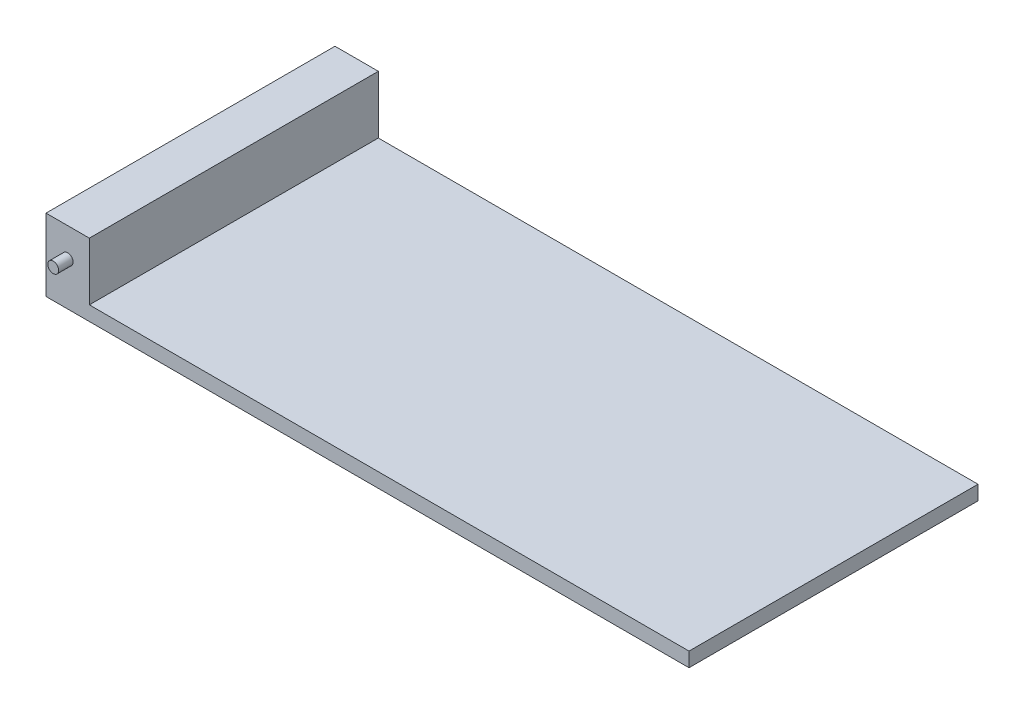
from build123d import *

# Parameters (mm, degrees)
SKETCH1_W           = 565.15
SKETCH1_H           = 12.7
EXTRUDE1_DEPTH      = 254
SKETCH7_W           = 38.1
SKETCH7_H           = 254
EXTRUDE4_DEPTH      = 50.8
SKETCH8_R           = 4.7625
BOSS_EXTRUDE1_DEPTH = 12.7


with BuildPart() as part:
    # Sketch1 → Extrude1 (new body)
    with BuildSketch(Plane.XY):
        with Locations((282.575, 6.35)):
            Rectangle(SKETCH1_W, SKETCH1_H)
    extrude(amount=EXTRUDE1_DEPTH)

    # Sketch7 → Extrude4 (add)
    with BuildSketch(Plane(origin=(0, 12.7, 0), x_dir=(-1, 0, 0), z_dir=(0, 1, 0))):
        with Locations((-19.05, 127)):
            Rectangle(SKETCH7_W, SKETCH7_H)
    extrude(amount=EXTRUDE4_DEPTH)

    # Sketch8 → Boss-Extrude1 (add)
    with BuildSketch(Plane.XY.offset(254)):
        with Locations(Location((19.05, 38.1, 0), (0, 0, 180))):
            Circle(SKETCH8_R)
    boss_extrude1 = extrude(amount=BOSS_EXTRUDE1_DEPTH)

    # Mirror1: Boss-Extrude1 across plane
    add(boss_extrude1.mirror(Plane.XY.offset(127)))


solid = part.part
